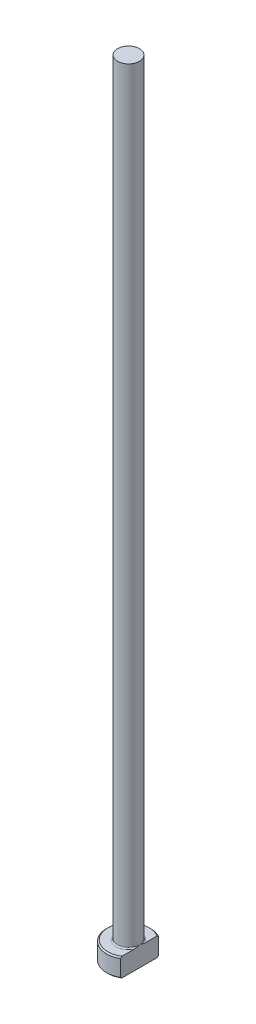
from build123d import *
from build123d.topology import SkipClean

# Parameters (mm, degrees)
CHAMFER1_SIZE = 0.2
FILLET1_R     = 0.2
KEY_DEPTH     = 126.097961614


with BuildPart() as part:
    # Sketch1 → Revolve1 (revolve)
    with BuildSketch(Plane.XY, mode=Mode.PRIVATE) as revolve1_sk:
        Polygon((0, 0), (-3.5, 0), (-3.5, 3), (-1.75, 3), (-1.75, 125), (0, 125), align=None)
    revolve(revolve1_sk.sketch.rotate(Axis((0, 259.958771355, 0), (0, -1, 0)), 270), axis=Axis((0, 259.958771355, 0), (0, -1, 0)))

    # Chamfer1
    chamfer1_edges = [part.edges().sort_by_distance(p)[0] for p in [
        (0, 3, -3.5),
        (0, 0, -3.5),
    ]]
    chamfer(chamfer1_edges, length=CHAMFER1_SIZE)

    # Fillet1
    fillet1_edges = [part.edges().sort_by_distance(p)[0] for p in [
        (0, 3, -1.75),
    ]]
    fillet(fillet1_edges, radius=FILLET1_R)

    # Sketch2 → KEY (cut, through all)
    with SkipClean():  # the faces are left unmerged after this step: merging them gives an invalid solid
        with BuildSketch(Plane(origin=(0, 0, 0), x_dir=(1, 0, 0), z_dir=(0, 1, 0))):
            with BuildLine():
                Line((1.75, 3.031088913), (1.75, -3.031088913))
                ThreePointArc((1.75, -3.031088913), (3.5, 0), (1.75, 3.031088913))
            make_face()
        extrude(amount=KEY_DEPTH, mode=Mode.SUBTRACT)


solid = part.part
